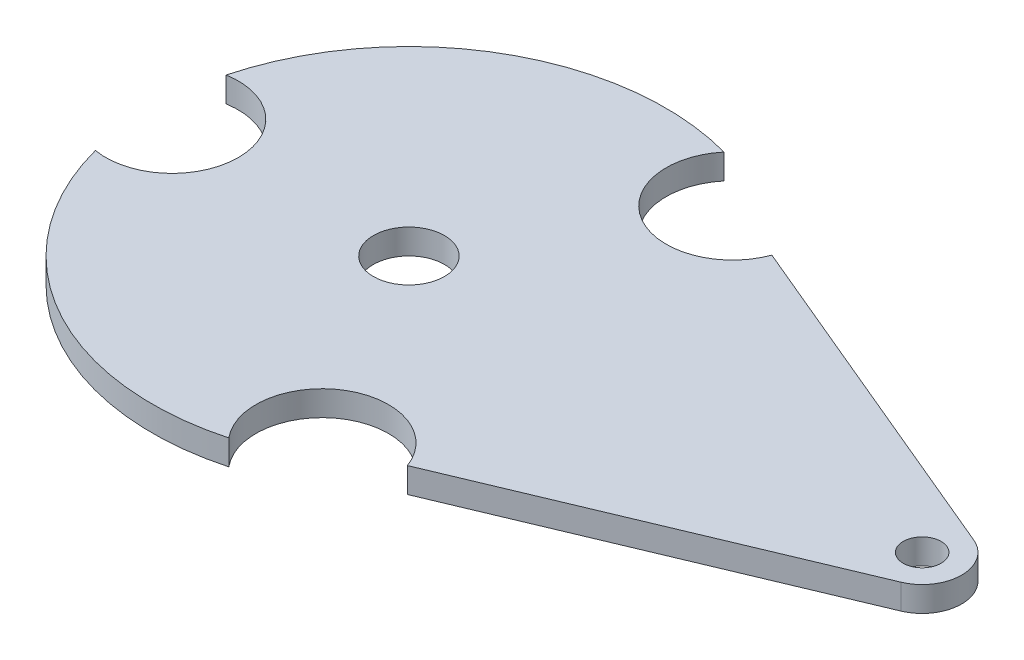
ISO-10303-21;
HEADER;
FILE_DESCRIPTION(('STEP AP214'),'2;1');
FILE_NAME('part.step','',(''),(''),'','','');
FILE_SCHEMA(('AUTOMOTIVE_DESIGN { 1 0 10303 214 1 1 1 1 }'));
ENDSEC;
DATA;
#1=APPLICATION_CONTEXT('core data for automotive mechanical design processes');
#2=APPLICATION_PROTOCOL_DEFINITION('international standard','automotive_design',2000,#1);
#3=PRODUCT_CONTEXT('',#1,'mechanical');
#4=PRODUCT('Part','Part','',(#3));
#5=PRODUCT_RELATED_PRODUCT_CATEGORY('part','',(#4));
#6=PRODUCT_DEFINITION_FORMATION('','',#4);
#7=PRODUCT_DEFINITION_CONTEXT('part definition',#1,'design');
#8=PRODUCT_DEFINITION('design','',#6,#7);
#9=PRODUCT_DEFINITION_SHAPE('','',#8);
#10=(LENGTH_UNIT() NAMED_UNIT(*) SI_UNIT(.MILLI.,.METRE.));
#11=(NAMED_UNIT(*) PLANE_ANGLE_UNIT() SI_UNIT($,.RADIAN.));
#12=(NAMED_UNIT(*) SI_UNIT($,.STERADIAN.) SOLID_ANGLE_UNIT());
#13=UNCERTAINTY_MEASURE_WITH_UNIT(LENGTH_MEASURE(1.E-05),#10,'distance_accuracy_value','');
#14=(GEOMETRIC_REPRESENTATION_CONTEXT(3) GLOBAL_UNCERTAINTY_ASSIGNED_CONTEXT((#13)) GLOBAL_UNIT_ASSIGNED_CONTEXT((#10,
#11,#12)) REPRESENTATION_CONTEXT('',''));
#15=CARTESIAN_POINT('',(0.,0.,0.));
#16=DIRECTION('',(0.,0.,1.));
#17=DIRECTION('',(1.,0.,0.));
#18=AXIS2_PLACEMENT_3D('',#15,#16,#17);
#19=CARTESIAN_POINT('',(7.50000000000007,0.79375,12.9903810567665));
#20=DIRECTION('',(0.,-1.,0.));
#21=DIRECTION('',(0.,0.,-1.));
#22=AXIS2_PLACEMENT_3D('',#19,#20,#21);
#23=CYLINDRICAL_SURFACE('',#22,4.2);
#24=CARTESIAN_POINT('',(7.50000000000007,-0.79375,12.9903810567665));
#25=DIRECTION('',(0.,-1.,0.));
#26=DIRECTION('',(0.,0.,1.));
#27=AXIS2_PLACEMENT_3D('',#24,#25,#26);
#28=CIRCLE('',#27,4.2);
#29=CARTESIAN_POINT('',(4.27269183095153,-0.79375,15.6782207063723));
#30=VERTEX_POINT('',#29);
#31=CARTESIAN_POINT('',(11.4413915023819,-0.79375,11.5393700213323));
#32=VERTEX_POINT('',#31);
#33=EDGE_CURVE('E139',#30,#32,#28,.T.);
#34=ORIENTED_EDGE('',*,*,#33,.T.);
#35=DIRECTION('',(0.,-1.,0.));
#36=VECTOR('',#35,1.);
#37=CARTESIAN_POINT('',(11.4413915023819,0.79375,11.5393700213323));
#38=LINE('',#37,#36);
#39=CARTESIAN_POINT('',(11.4413915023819,0.79375,11.5393700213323));
#40=VERTEX_POINT('',#39);
#41=EDGE_CURVE('E11',#40,#32,#38,.T.);
#42=ORIENTED_EDGE('',*,*,#41,.F.);
#43=CARTESIAN_POINT('',(7.50000000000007,0.79375,12.9903810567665));
#44=DIRECTION('',(0.,-1.,0.));
#45=DIRECTION('',(0.,0.,1.));
#46=AXIS2_PLACEMENT_3D('',#43,#44,#45);
#47=CIRCLE('',#46,4.2);
#48=CARTESIAN_POINT('',(4.27269183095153,0.79375,15.6782207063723));
#49=VERTEX_POINT('',#48);
#50=EDGE_CURVE('E162',#49,#40,#47,.T.);
#51=ORIENTED_EDGE('',*,*,#50,.F.);
#52=DIRECTION('',(0.,-1.,0.));
#53=VECTOR('',#52,1.);
#54=CARTESIAN_POINT('',(4.27269183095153,0.79375,15.6782207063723));
#55=LINE('',#54,#53);
#56=EDGE_CURVE('E135',#49,#30,#55,.T.);
#57=ORIENTED_EDGE('',*,*,#56,.T.);
#58=EDGE_LOOP('',(#34,#42,#51,#57));
#59=FACE_BOUND('',#58,.T.);
#60=ADVANCED_FACE('F36',(#59),#23,.F.);
#61=CARTESIAN_POINT('',(11.4413915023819,0.79375,11.5393700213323));
#62=DIRECTION('',(-0.386634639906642,0.,-0.922232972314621));
#63=DIRECTION('',(-0.922232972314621,0.,0.386634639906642));
#64=AXIS2_PLACEMENT_3D('',#61,#62,#63);
#65=PLANE('',#64);
#66=DIRECTION('',(0.922232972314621,0.,-0.386634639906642));
#67=VECTOR('',#66,1.);
#68=CARTESIAN_POINT('',(11.4413915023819,-0.79375,11.5393700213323));
#69=LINE('',#68,#67);
#70=CARTESIAN_POINT('',(33.4665865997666,-0.79375,2.30558243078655));
#71=VERTEX_POINT('',#70);
#72=EDGE_CURVE('E143',#32,#71,#69,.T.);
#73=ORIENTED_EDGE('',*,*,#72,.T.);
#74=DIRECTION('',(0.,-1.,0.));
#75=VECTOR('',#74,1.);
#76=CARTESIAN_POINT('',(33.4665865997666,0.79375,2.30558243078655));
#77=LINE('',#76,#75);
#78=CARTESIAN_POINT('',(33.4665865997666,0.79375,2.30558243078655));
#79=VERTEX_POINT('',#78);
#80=EDGE_CURVE('E45',#79,#71,#77,.T.);
#81=ORIENTED_EDGE('',*,*,#80,.F.);
#82=DIRECTION('',(0.922232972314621,0.,-0.386634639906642));
#83=VECTOR('',#82,1.);
#84=CARTESIAN_POINT('',(11.4413915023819,0.79375,11.5393700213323));
#85=LINE('',#84,#83);
#86=EDGE_CURVE('E96',#40,#79,#85,.T.);
#87=ORIENTED_EDGE('',*,*,#86,.F.);
#88=ORIENTED_EDGE('',*,*,#41,.T.);
#89=EDGE_LOOP('',(#73,#81,#87,#88));
#90=FACE_BOUND('',#89,.T.);
#91=ADVANCED_FACE('F242',(#90),#65,.F.);
#92=CARTESIAN_POINT('',(32.5,0.79375,0.));
#93=DIRECTION('',(0.,-1.,0.));
#94=DIRECTION('',(0.,0.,-1.));
#95=AXIS2_PLACEMENT_3D('',#92,#93,#94);
#96=CYLINDRICAL_SURFACE('',#95,2.5);
#97=CARTESIAN_POINT('',(32.5,-0.79375,0.));
#98=DIRECTION('',(0.,1.,0.));
#99=DIRECTION('',(0.,0.,1.));
#100=AXIS2_PLACEMENT_3D('',#97,#98,#99);
#101=CIRCLE('',#100,2.5);
#102=CARTESIAN_POINT('',(33.4665865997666,-0.79375,-2.30558243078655));
#103=VERTEX_POINT('',#102);
#104=EDGE_CURVE('E147',#71,#103,#101,.T.);
#105=ORIENTED_EDGE('',*,*,#104,.T.);
#106=DIRECTION('',(0.,-1.,0.));
#107=VECTOR('',#106,1.);
#108=CARTESIAN_POINT('',(33.4665865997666,0.79375,-2.30558243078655));
#109=LINE('',#108,#107);
#110=CARTESIAN_POINT('',(33.4665865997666,0.79375,-2.30558243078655));
#111=VERTEX_POINT('',#110);
#112=EDGE_CURVE('E173',#111,#103,#109,.T.);
#113=ORIENTED_EDGE('',*,*,#112,.F.);
#114=CARTESIAN_POINT('',(32.5,0.79375,0.));
#115=DIRECTION('',(0.,1.,0.));
#116=DIRECTION('',(0.,0.,1.));
#117=AXIS2_PLACEMENT_3D('',#114,#115,#116);
#118=CIRCLE('',#117,2.5);
#119=EDGE_CURVE('E181',#79,#111,#118,.T.);
#120=ORIENTED_EDGE('',*,*,#119,.F.);
#121=ORIENTED_EDGE('',*,*,#80,.T.);
#122=EDGE_LOOP('',(#105,#113,#120,#121));
#123=FACE_BOUND('',#122,.T.);
#124=ADVANCED_FACE('F179',(#123),#96,.T.);
#125=CARTESIAN_POINT('',(11.4413915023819,0.79375,-11.5393700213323));
#126=DIRECTION('',(-0.386634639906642,0.,0.922232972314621));
#127=DIRECTION('',(0.922232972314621,0.,0.386634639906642));
#128=AXIS2_PLACEMENT_3D('',#125,#126,#127);
#129=PLANE('',#128);
#130=DIRECTION('',(-0.922232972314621,0.,-0.386634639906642));
#131=VECTOR('',#130,1.);
#132=CARTESIAN_POINT('',(11.4413915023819,-0.79375,-11.5393700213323));
#133=LINE('',#132,#131);
#134=CARTESIAN_POINT('',(11.4413915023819,-0.79375,-11.5393700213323));
#135=VERTEX_POINT('',#134);
#136=EDGE_CURVE('E150',#103,#135,#133,.T.);
#137=ORIENTED_EDGE('',*,*,#136,.T.);
#138=DIRECTION('',(0.,-1.,0.));
#139=VECTOR('',#138,1.);
#140=CARTESIAN_POINT('',(11.4413915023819,0.79375,-11.5393700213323));
#141=LINE('',#140,#139);
#142=CARTESIAN_POINT('',(11.4413915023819,0.79375,-11.5393700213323));
#143=VERTEX_POINT('',#142);
#144=EDGE_CURVE('E169',#143,#135,#141,.T.);
#145=ORIENTED_EDGE('',*,*,#144,.F.);
#146=DIRECTION('',(-0.922232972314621,0.,-0.386634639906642));
#147=VECTOR('',#146,1.);
#148=CARTESIAN_POINT('',(11.4413915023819,0.79375,-11.5393700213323));
#149=LINE('',#148,#147);
#150=EDGE_CURVE('E194',#111,#143,#149,.T.);
#151=ORIENTED_EDGE('',*,*,#150,.F.);
#152=ORIENTED_EDGE('',*,*,#112,.T.);
#153=EDGE_LOOP('',(#137,#145,#151,#152));
#154=FACE_BOUND('',#153,.T.);
#155=ADVANCED_FACE('F189',(#154),#129,.F.);
#156=CARTESIAN_POINT('',(7.50000000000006,0.79375,-12.9903810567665));
#157=DIRECTION('',(0.,-1.,0.));
#158=DIRECTION('',(0.,0.,-1.));
#159=AXIS2_PLACEMENT_3D('',#156,#157,#158);
#160=CYLINDRICAL_SURFACE('',#159,4.2);
#161=CARTESIAN_POINT('',(7.50000000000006,-0.79375,-12.9903810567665));
#162=DIRECTION('',(0.,-1.,0.));
#163=DIRECTION('',(0.,0.,1.));
#164=AXIS2_PLACEMENT_3D('',#161,#162,#163);
#165=CIRCLE('',#164,4.2);
#166=CARTESIAN_POINT('',(4.27269183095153,-0.79375,-15.6782207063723));
#167=VERTEX_POINT('',#166);
#168=EDGE_CURVE('E153',#135,#167,#165,.T.);
#169=ORIENTED_EDGE('',*,*,#168,.T.);
#170=DIRECTION('',(0.,-1.,0.));
#171=VECTOR('',#170,1.);
#172=CARTESIAN_POINT('',(4.27269183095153,0.79375,-15.6782207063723));
#173=LINE('',#172,#171);
#174=CARTESIAN_POINT('',(4.27269183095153,0.79375,-15.6782207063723));
#175=VERTEX_POINT('',#174);
#176=EDGE_CURVE('E126',#175,#167,#173,.T.);
#177=ORIENTED_EDGE('',*,*,#176,.F.);
#178=CARTESIAN_POINT('',(7.50000000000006,0.79375,-12.9903810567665));
#179=DIRECTION('',(0.,-1.,0.));
#180=DIRECTION('',(0.,0.,1.));
#181=AXIS2_PLACEMENT_3D('',#178,#179,#180);
#182=CIRCLE('',#181,4.2);
#183=EDGE_CURVE('E115',#143,#175,#182,.T.);
#184=ORIENTED_EDGE('',*,*,#183,.F.);
#185=ORIENTED_EDGE('',*,*,#144,.T.);
#186=EDGE_LOOP('',(#169,#177,#184,#185));
#187=FACE_BOUND('',#186,.T.);
#188=ADVANCED_FACE('F192',(#187),#160,.F.);
#189=CARTESIAN_POINT('',(0.,0.79375,0.));
#190=DIRECTION('',(0.,-1.,0.));
#191=DIRECTION('',(0.,0.,-1.));
#192=AXIS2_PLACEMENT_3D('',#189,#190,#191);
#193=CYLINDRICAL_SURFACE('',#192,16.25);
#194=CARTESIAN_POINT('',(0.,-0.79375,0.));
#195=DIRECTION('',(0.,1.,0.));
#196=DIRECTION('',(0.,0.,1.));
#197=AXIS2_PLACEMENT_3D('',#194,#195,#196);
#198=CIRCLE('',#197,16.25);
#199=CARTESIAN_POINT('',(-15.7140833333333,-0.79375,-4.13885068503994));
#200=VERTEX_POINT('',#199);
#201=EDGE_CURVE('E124',#167,#200,#198,.T.);
#202=ORIENTED_EDGE('',*,*,#201,.T.);
#203=DIRECTION('',(0.,-1.,0.));
#204=VECTOR('',#203,1.);
#205=CARTESIAN_POINT('',(-15.7140833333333,0.79375,-4.13885068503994));
#206=LINE('',#205,#204);
#207=CARTESIAN_POINT('',(-15.7140833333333,0.79375,-4.13885068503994));
#208=VERTEX_POINT('',#207);
#209=EDGE_CURVE('E121',#208,#200,#206,.T.);
#210=ORIENTED_EDGE('',*,*,#209,.F.);
#211=CARTESIAN_POINT('',(0.,0.79375,0.));
#212=DIRECTION('',(0.,1.,0.));
#213=DIRECTION('',(0.,0.,1.));
#214=AXIS2_PLACEMENT_3D('',#211,#212,#213);
#215=CIRCLE('',#214,16.25);
#216=EDGE_CURVE('E109',#175,#208,#215,.T.);
#217=ORIENTED_EDGE('',*,*,#216,.F.);
#218=ORIENTED_EDGE('',*,*,#176,.T.);
#219=EDGE_LOOP('',(#202,#210,#217,#218));
#220=FACE_BOUND('',#219,.T.);
#221=ADVANCED_FACE('F122',(#220),#193,.T.);
#222=CARTESIAN_POINT('',(-15.,0.79375,0.));
#223=DIRECTION('',(0.,-1.,0.));
#224=DIRECTION('',(0.,0.,-1.));
#225=AXIS2_PLACEMENT_3D('',#222,#223,#224);
#226=CYLINDRICAL_SURFACE('',#225,4.2);
#227=CARTESIAN_POINT('',(-15.,-0.79375,0.));
#228=DIRECTION('',(0.,-1.,0.));
#229=DIRECTION('',(0.,0.,1.));
#230=AXIS2_PLACEMENT_3D('',#227,#228,#229);
#231=CIRCLE('',#230,4.2);
#232=CARTESIAN_POINT('',(-15.7140833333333,-0.79375,4.13885068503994));
#233=VERTEX_POINT('',#232);
#234=EDGE_CURVE('E82',#200,#233,#231,.T.);
#235=ORIENTED_EDGE('',*,*,#234,.T.);
#236=DIRECTION('',(0.,-1.,0.));
#237=VECTOR('',#236,1.);
#238=CARTESIAN_POINT('',(-15.7140833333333,0.79375,4.13885068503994));
#239=LINE('',#238,#237);
#240=CARTESIAN_POINT('',(-15.7140833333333,0.79375,4.13885068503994));
#241=VERTEX_POINT('',#240);
#242=EDGE_CURVE('E127',#241,#233,#239,.T.);
#243=ORIENTED_EDGE('',*,*,#242,.F.);
#244=CARTESIAN_POINT('',(-15.,0.79375,0.));
#245=DIRECTION('',(0.,-1.,0.));
#246=DIRECTION('',(0.,0.,1.));
#247=AXIS2_PLACEMENT_3D('',#244,#245,#246);
#248=CIRCLE('',#247,4.2);
#249=EDGE_CURVE('E113',#208,#241,#248,.T.);
#250=ORIENTED_EDGE('',*,*,#249,.F.);
#251=ORIENTED_EDGE('',*,*,#209,.T.);
#252=EDGE_LOOP('',(#235,#243,#250,#251));
#253=FACE_BOUND('',#252,.T.);
#254=ADVANCED_FACE('F129',(#253),#226,.F.);
#255=CARTESIAN_POINT('',(0.,0.79375,0.));
#256=DIRECTION('',(0.,-1.,0.));
#257=DIRECTION('',(0.,0.,-1.));
#258=AXIS2_PLACEMENT_3D('',#255,#256,#257);
#259=CYLINDRICAL_SURFACE('',#258,16.25);
#260=CARTESIAN_POINT('',(0.,-0.79375,0.));
#261=DIRECTION('',(0.,1.,0.));
#262=DIRECTION('',(0.,0.,1.));
#263=AXIS2_PLACEMENT_3D('',#260,#261,#262);
#264=CIRCLE('',#263,16.25);
#265=EDGE_CURVE('E88',#233,#30,#264,.T.);
#266=ORIENTED_EDGE('',*,*,#265,.T.);
#267=ORIENTED_EDGE('',*,*,#56,.F.);
#268=CARTESIAN_POINT('',(0.,0.79375,0.));
#269=DIRECTION('',(0.,1.,0.));
#270=DIRECTION('',(0.,0.,1.));
#271=AXIS2_PLACEMENT_3D('',#268,#269,#270);
#272=CIRCLE('',#271,16.25);
#273=EDGE_CURVE('E53',#241,#49,#272,.T.);
#274=ORIENTED_EDGE('',*,*,#273,.F.);
#275=ORIENTED_EDGE('',*,*,#242,.T.);
#276=EDGE_LOOP('',(#266,#267,#274,#275));
#277=FACE_BOUND('',#276,.T.);
#278=ADVANCED_FACE('F224',(#277),#259,.T.);
#279=CARTESIAN_POINT('',(7.50000000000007,0.79375,12.9903810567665));
#280=DIRECTION('',(0.,1.,0.));
#281=DIRECTION('',(0.,0.,1.));
#282=AXIS2_PLACEMENT_3D('',#279,#280,#281);
#283=PLANE('',#282);
#284=CARTESIAN_POINT('',(32.5,0.79375,0.));
#285=DIRECTION('',(0.,1.,0.));
#286=DIRECTION('',(0.,0.,1.));
#287=AXIS2_PLACEMENT_3D('',#284,#285,#286);
#288=CIRCLE('',#287,1.2);
#289=CARTESIAN_POINT('',(32.5,0.79375,1.2));
#290=VERTEX_POINT('',#289);
#291=EDGE_CURVE('E215',#290,#290,#288,.T.);
#292=ORIENTED_EDGE('',*,*,#291,.F.);
#293=EDGE_LOOP('',(#292));
#294=FACE_BOUND('',#293,.T.);
#295=CARTESIAN_POINT('',(0.,0.793750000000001,0.));
#296=DIRECTION('',(0.,1.,0.));
#297=DIRECTION('',(0.,0.,1.));
#298=AXIS2_PLACEMENT_3D('',#295,#296,#297);
#299=CIRCLE('',#298,2.24999999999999);
#300=CARTESIAN_POINT('',(0.,0.793750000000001,2.24999999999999));
#301=VERTEX_POINT('',#300);
#302=EDGE_CURVE('E207',#301,#301,#299,.T.);
#303=ORIENTED_EDGE('',*,*,#302,.F.);
#304=EDGE_LOOP('',(#303));
#305=FACE_BOUND('',#304,.T.);
#306=ORIENTED_EDGE('',*,*,#50,.T.);
#307=ORIENTED_EDGE('',*,*,#86,.T.);
#308=ORIENTED_EDGE('',*,*,#119,.T.);
#309=ORIENTED_EDGE('',*,*,#150,.T.);
#310=ORIENTED_EDGE('',*,*,#183,.T.);
#311=ORIENTED_EDGE('',*,*,#216,.T.);
#312=ORIENTED_EDGE('',*,*,#249,.T.);
#313=ORIENTED_EDGE('',*,*,#273,.T.);
#314=EDGE_LOOP('',(#306,#307,#308,#309,#310,#311,#312,#313));
#315=FACE_BOUND('',#314,.T.);
#316=ADVANCED_FACE('F111',(#294,#305,#315),#283,.T.);
#317=CARTESIAN_POINT('',(7.50000000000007,-0.79375,12.9903810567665));
#318=DIRECTION('',(0.,1.,0.));
#319=DIRECTION('',(0.,0.,1.));
#320=AXIS2_PLACEMENT_3D('',#317,#318,#319);
#321=PLANE('',#320);
#322=CARTESIAN_POINT('',(32.5,-0.79375,0.));
#323=DIRECTION('',(0.,1.,0.));
#324=DIRECTION('',(0.,0.,1.));
#325=AXIS2_PLACEMENT_3D('',#322,#323,#324);
#326=CIRCLE('',#325,1.2);
#327=CARTESIAN_POINT('',(32.5,-0.79375,1.2));
#328=VERTEX_POINT('',#327);
#329=EDGE_CURVE('E211',#328,#328,#326,.T.);
#330=ORIENTED_EDGE('',*,*,#329,.T.);
#331=EDGE_LOOP('',(#330));
#332=FACE_BOUND('',#331,.T.);
#333=CARTESIAN_POINT('',(0.,-0.79375,0.));
#334=DIRECTION('',(0.,1.,0.));
#335=DIRECTION('',(0.,0.,1.));
#336=AXIS2_PLACEMENT_3D('',#333,#334,#335);
#337=CIRCLE('',#336,2.24999999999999);
#338=CARTESIAN_POINT('',(0.,-0.79375,2.24999999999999));
#339=VERTEX_POINT('',#338);
#340=EDGE_CURVE('E144',#339,#339,#337,.T.);
#341=ORIENTED_EDGE('',*,*,#340,.T.);
#342=EDGE_LOOP('',(#341));
#343=FACE_BOUND('',#342,.T.);
#344=ORIENTED_EDGE('',*,*,#33,.F.);
#345=ORIENTED_EDGE('',*,*,#265,.F.);
#346=ORIENTED_EDGE('',*,*,#234,.F.);
#347=ORIENTED_EDGE('',*,*,#201,.F.);
#348=ORIENTED_EDGE('',*,*,#168,.F.);
#349=ORIENTED_EDGE('',*,*,#136,.F.);
#350=ORIENTED_EDGE('',*,*,#104,.F.);
#351=ORIENTED_EDGE('',*,*,#72,.F.);
#352=EDGE_LOOP('',(#344,#345,#346,#347,#348,#349,#350,#351));
#353=FACE_BOUND('',#352,.T.);
#354=ADVANCED_FACE('F185',(#332,#343,#353),#321,.F.);
#355=CARTESIAN_POINT('',(0.,0.79375,0.));
#356=DIRECTION('',(0.,1.,0.));
#357=DIRECTION('',(0.,0.,1.));
#358=AXIS2_PLACEMENT_3D('',#355,#356,#357);
#359=CYLINDRICAL_SURFACE('',#358,2.24999999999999);
#360=ORIENTED_EDGE('',*,*,#340,.F.);
#361=EDGE_LOOP('',(#360));
#362=FACE_BOUND('',#361,.T.);
#363=ORIENTED_EDGE('',*,*,#302,.T.);
#364=EDGE_LOOP('',(#363));
#365=FACE_BOUND('',#364,.T.);
#366=ADVANCED_FACE('F228',(#362,#365),#359,.F.);
#367=CARTESIAN_POINT('',(32.5,0.79375,0.));
#368=DIRECTION('',(0.,1.,0.));
#369=DIRECTION('',(0.,0.,1.));
#370=AXIS2_PLACEMENT_3D('',#367,#368,#369);
#371=CYLINDRICAL_SURFACE('',#370,1.2);
#372=ORIENTED_EDGE('',*,*,#329,.F.);
#373=EDGE_LOOP('',(#372));
#374=FACE_BOUND('',#373,.T.);
#375=ORIENTED_EDGE('',*,*,#291,.T.);
#376=EDGE_LOOP('',(#375));
#377=FACE_BOUND('',#376,.T.);
#378=ADVANCED_FACE('F220',(#374,#377),#371,.F.);
#379=CLOSED_SHELL('',(#60,#91,#124,#155,#188,#221,#254,#278,#316,#354,#366,#378));
#380=MANIFOLD_SOLID_BREP('B2',#379);
#381=ADVANCED_BREP_SHAPE_REPRESENTATION('',(#18,#380),#14);
#382=SHAPE_DEFINITION_REPRESENTATION(#9,#381);
ENDSEC;
END-ISO-10303-21;
